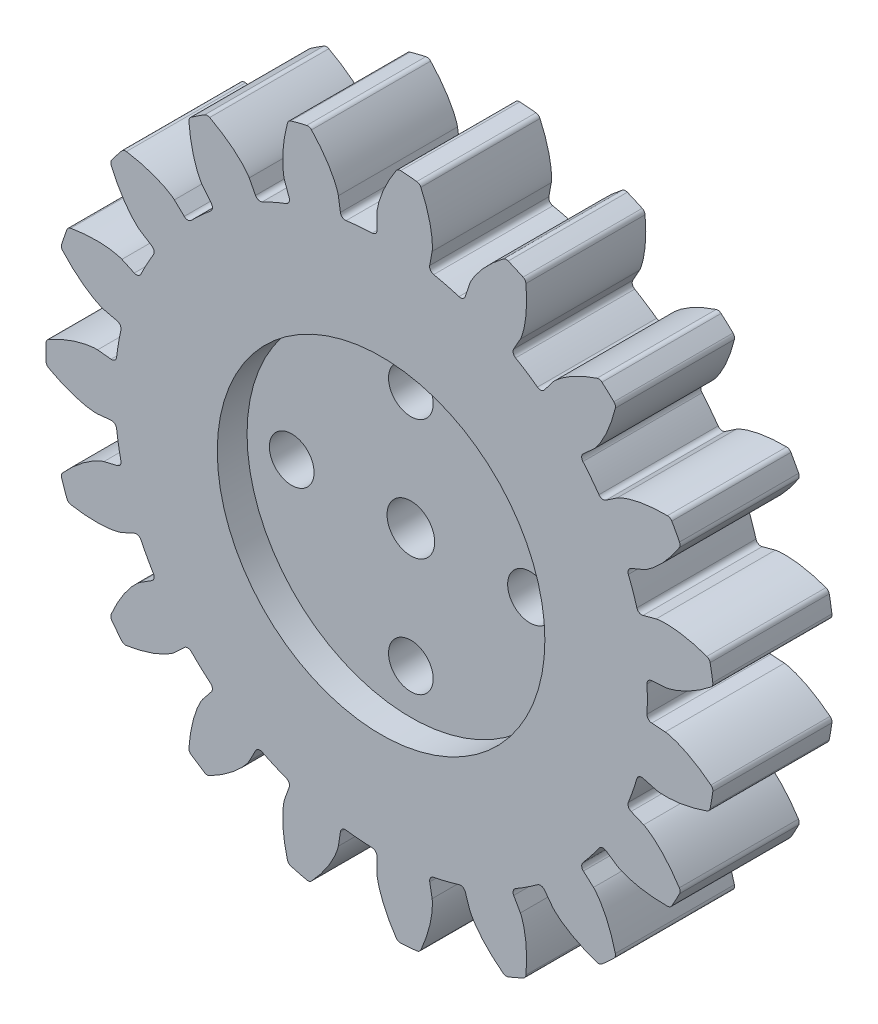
from build123d import *

# Parameters (mm, degrees)
SKETCH10_R                = 22.5
SKETCH10_R_2              = 1.25
BOSS_EXTRUDE5_DEPTH       = 10
CUT_EXTRUDE1_DEPTH        = 34.35416016
FILLET1_R                 = 0.34
CIRPATTERN1_COUNT         = 19
CIRPATTERN1_COPY_1_DEPTH  = 34.35416016
CIRPATTERN1_COPY_2_DEPTH  = 34.35416016
CIRPATTERN1_COPY_3_DEPTH  = 34.35416016
CIRPATTERN1_COPY_4_DEPTH  = 34.35416016
CIRPATTERN1_COPY_5_DEPTH  = 34.35416016
CIRPATTERN1_COPY_6_DEPTH  = 34.35416016
CIRPATTERN1_COPY_7_DEPTH  = 34.35416016
CIRPATTERN1_COPY_8_DEPTH  = 34.35416016
CIRPATTERN1_COPY_9_DEPTH  = 34.35416016
CIRPATTERN1_COPY_10_DEPTH = 34.35416016
CIRPATTERN1_COPY_11_DEPTH = 34.35416016
CIRPATTERN1_COPY_12_DEPTH = 34.35416016
CIRPATTERN1_COPY_13_DEPTH = 34.35416016
CIRPATTERN1_COPY_14_DEPTH = 34.35416016
CIRPATTERN1_COPY_15_DEPTH = 34.35416016
CIRPATTERN1_COPY_16_DEPTH = 34.35416016
CIRPATTERN1_COPY_17_DEPTH = 34.35416016
CIRPATTERN1_COPY_18_DEPTH = 34.35416016
FILLET1_OF_CIRPATTERN1_R  = 0.34
SKETCH12_R                = 11
CUT_EXTRUDE2_DEPTH        = 2
SKETCH13_R                = 1.6
CUT_EXTRUDE3_DEPTH        = 33.784090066
SKETCH14_R                = 1.5
CUT_EXTRUDE4_DEPTH        = 6
CROQUIS1_W                = 59.376573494
CROQUIS1_H                = 51.526039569
CORTAR_EXTRUIR1_DEPTH     = 2


with BuildPart() as part:
    # Sketch10 → Boss-Extrude5 (new body)
    with BuildSketch(Plane.XY):
        Circle(SKETCH10_R)
        Circle(SKETCH10_R_2, mode=Mode.SUBTRACT)
    extrude(amount=BOSS_EXTRUDE5_DEPTH)

    # Sketch11 → Cut-Extrude1 (cut, through all)
    with BuildSketch(Plane.XY.offset(10)):
        with BuildLine():
            Line((17.88, 0), (22.500466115, 0))
            ThreePointArc((22.500466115, 0), (22.451062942, 1.490217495), (22.303070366, 2.973890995))
            add(Edge.make_bspline(
                [(19.085941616, 1.295420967), (19.091347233, 1.295859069), (19.106491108, 1.297307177), (19.135048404, 1.300910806), (19.181520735, 1.308018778), (19.240530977, 1.318877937), (19.316536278, 1.334978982), (19.40569711, 1.356597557), (19.503249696, 1.383126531), (19.608873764, 1.414970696), (19.713766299, 1.449369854), (19.817921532, 1.486125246), (19.921223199, 1.524936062), (20.045785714, 1.574535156), (20.194335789, 1.637599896), (20.366697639, 1.716517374), (20.56061638, 1.812144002), (20.756460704, 1.916106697), (20.947660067, 2.023736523), (21.138990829, 2.138563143), (21.322794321, 2.253970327), (21.511680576, 2.380010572), (21.685008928, 2.499494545), (21.876829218, 2.640122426), (22.030947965, 2.755590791), (22.188094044, 2.880463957), (22.264270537, 2.942063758), (22.303070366, 2.973890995)],
                knots=[0, 0, 0, 0, 0, 0.005376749, 0.015083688, 0.02853182, 0.04661014, 0.064854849, 0.092110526, 0.119476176, 0.146842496, 0.174208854, 0.201574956, 0.228941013, 0.256307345, 0.307035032, 0.361767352, 0.416499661, 0.471231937, 0.525964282, 0.580696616, 0.635428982, 0.690161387, 0.744893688, 0.799626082, 0.854358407, 0.909090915, 0.909090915, 0.909090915, 0.909090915, 0.909090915], degree=4))
            Line((19.085941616, 1.295420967), (17.838957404, 1.210784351))
            ThreePointArc((17.838957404, 1.210784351), (17.869736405, 0.605739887), (17.88, 0))
        make_face()
    cut_extrude1 = extrude(amount=-CUT_EXTRUDE1_DEPTH, mode=Mode.SUBTRACT)

    # Mirror1: Cut-Extrude1 across plane
    add(cut_extrude1.mirror(Plane(origin=(17.88, 0, 0), x_dir=(0, 0, 1), z_dir=(0, -1, 0))), mode=Mode.SUBTRACT)

    # Fillet1
    fillet1_edges = [part.edges().sort_by_distance(p)[0] for p in [
        (17.838957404, -1.210784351, 5),
        (22.302646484, -2.973543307, 5),
        (22.302646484, 2.973543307, 5),
        (17.838957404, 1.210784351, 5),
    ]]
    fillet(fillet1_edges, radius=FILLET1_R)

    # CirPattern1: Cut-Extrude1 ×19 about axis
    cirpattern1_axis = Axis((0, 0, 10), (0, 0, -1))
    for i in range(1, CIRPATTERN1_COUNT):
        add(cut_extrude1.rotate(cirpattern1_axis, i * 360 / CIRPATTERN1_COUNT), mode=Mode.SUBTRACT)

    # CirPattern1 copy 1 sketch → CirPattern1 copy 1 (cut, through all)
    with BuildSketch(Plane(origin=(0, 0, 10), x_dir=(0.9458172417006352, -0.3246994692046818, 0), z_dir=(0, 0, 1))):
        with BuildLine():
            Line((17.88, 0), (22.500466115, 0))
            ThreePointArc((22.500466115, 0), (22.451062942, -1.490217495), (22.303070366, -2.973890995))
            add(Edge.make_bspline(
                [(19.085941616, -1.295420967), (19.091347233, -1.295859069), (19.106491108, -1.297307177), (19.135048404, -1.300910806), (19.181520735, -1.308018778), (19.240530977, -1.318877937), (19.316536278, -1.334978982), (19.40569711, -1.356597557), (19.503249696, -1.383126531), (19.608873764, -1.414970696), (19.713766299, -1.449369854), (19.817921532, -1.486125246), (19.921223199, -1.524936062), (20.045785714, -1.574535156), (20.194335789, -1.637599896), (20.366697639, -1.716517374), (20.56061638, -1.812144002), (20.756460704, -1.916106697), (20.947660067, -2.023736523), (21.138990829, -2.138563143), (21.322794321, -2.253970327), (21.511680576, -2.380010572), (21.685008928, -2.499494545), (21.876829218, -2.640122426), (22.030947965, -2.755590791), (22.188094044, -2.880463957), (22.264270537, -2.942063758), (22.303070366, -2.973890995)],
                knots=[0, 0, 0, 0, 0, 0.005376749, 0.015083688, 0.02853182, 0.04661014, 0.064854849, 0.092110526, 0.119476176, 0.146842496, 0.174208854, 0.201574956, 0.228941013, 0.256307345, 0.307035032, 0.361767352, 0.416499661, 0.471231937, 0.525964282, 0.580696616, 0.635428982, 0.690161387, 0.744893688, 0.799626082, 0.854358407, 0.909090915, 0.909090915, 0.909090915, 0.909090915, 0.909090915], degree=4))
            Line((19.085941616, -1.295420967), (17.838957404, -1.210784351))
            ThreePointArc((17.838957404, -1.210784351), (17.869736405, -0.605739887), (17.88, 0))
        make_face()
    extrude(amount=-CIRPATTERN1_COPY_1_DEPTH, mode=Mode.SUBTRACT)

    # CirPattern1 copy 2 sketch → CirPattern1 copy 2 (cut, through all)
    with BuildSketch(Plane(origin=(0, 0, 10), x_dir=(0.7891405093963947, -0.6142127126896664, 0), z_dir=(0, 0, 1))):
        with BuildLine():
            Line((17.88, 0), (22.500466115, 0))
            ThreePointArc((22.500466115, 0), (22.451062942, -1.490217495), (22.303070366, -2.973890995))
            add(Edge.make_bspline(
                [(19.085941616, -1.295420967), (19.091347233, -1.295859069), (19.106491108, -1.297307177), (19.135048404, -1.300910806), (19.181520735, -1.308018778), (19.240530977, -1.318877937), (19.316536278, -1.334978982), (19.40569711, -1.356597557), (19.503249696, -1.383126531), (19.608873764, -1.414970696), (19.713766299, -1.449369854), (19.817921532, -1.486125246), (19.921223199, -1.524936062), (20.045785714, -1.574535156), (20.194335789, -1.637599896), (20.366697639, -1.716517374), (20.56061638, -1.812144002), (20.756460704, -1.916106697), (20.947660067, -2.023736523), (21.138990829, -2.138563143), (21.322794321, -2.253970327), (21.511680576, -2.380010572), (21.685008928, -2.499494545), (21.876829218, -2.640122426), (22.030947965, -2.755590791), (22.188094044, -2.880463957), (22.264270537, -2.942063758), (22.303070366, -2.973890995)],
                knots=[0, 0, 0, 0, 0, 0.005376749, 0.015083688, 0.02853182, 0.04661014, 0.064854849, 0.092110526, 0.119476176, 0.146842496, 0.174208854, 0.201574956, 0.228941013, 0.256307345, 0.307035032, 0.361767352, 0.416499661, 0.471231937, 0.525964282, 0.580696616, 0.635428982, 0.690161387, 0.744893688, 0.799626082, 0.854358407, 0.909090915, 0.909090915, 0.909090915, 0.909090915, 0.909090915], degree=4))
            Line((19.085941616, -1.295420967), (17.838957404, -1.210784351))
            ThreePointArc((17.838957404, -1.210784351), (17.869736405, -0.605739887), (17.88, 0))
        make_face()
    extrude(amount=-CIRPATTERN1_COPY_2_DEPTH, mode=Mode.SUBTRACT)

    # CirPattern1 copy 3 sketch → CirPattern1 copy 3 (cut, through all)
    with BuildSketch(Plane(origin=(0, 0, 10), x_dir=(0.5469481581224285, -0.8371664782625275, 0), z_dir=(0, 0, 1))):
        with BuildLine():
            Line((17.88, 0), (22.500466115, 0))
            ThreePointArc((22.500466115, 0), (22.451062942, -1.490217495), (22.303070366, -2.973890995))
            add(Edge.make_bspline(
                [(19.085941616, -1.295420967), (19.091347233, -1.295859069), (19.106491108, -1.297307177), (19.135048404, -1.300910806), (19.181520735, -1.308018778), (19.240530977, -1.318877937), (19.316536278, -1.334978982), (19.40569711, -1.356597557), (19.503249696, -1.383126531), (19.608873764, -1.414970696), (19.713766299, -1.449369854), (19.817921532, -1.486125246), (19.921223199, -1.524936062), (20.045785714, -1.574535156), (20.194335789, -1.637599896), (20.366697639, -1.716517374), (20.56061638, -1.812144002), (20.756460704, -1.916106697), (20.947660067, -2.023736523), (21.138990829, -2.138563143), (21.322794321, -2.253970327), (21.511680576, -2.380010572), (21.685008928, -2.499494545), (21.876829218, -2.640122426), (22.030947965, -2.755590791), (22.188094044, -2.880463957), (22.264270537, -2.942063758), (22.303070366, -2.973890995)],
                knots=[0, 0, 0, 0, 0, 0.005376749, 0.015083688, 0.02853182, 0.04661014, 0.064854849, 0.092110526, 0.119476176, 0.146842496, 0.174208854, 0.201574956, 0.228941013, 0.256307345, 0.307035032, 0.361767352, 0.416499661, 0.471231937, 0.525964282, 0.580696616, 0.635428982, 0.690161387, 0.744893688, 0.799626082, 0.854358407, 0.909090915, 0.909090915, 0.909090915, 0.909090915, 0.909090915], degree=4))
            Line((19.085941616, -1.295420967), (17.838957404, -1.210784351))
            ThreePointArc((17.838957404, -1.210784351), (17.869736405, -0.605739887), (17.88, 0))
        make_face()
    extrude(amount=-CIRPATTERN1_COPY_3_DEPTH, mode=Mode.SUBTRACT)

    # CirPattern1 copy 4 sketch → CirPattern1 copy 4 (cut, through all)
    with BuildSketch(Plane(origin=(0, 0, 10), x_dir=(0.24548548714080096, -0.9694002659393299, 0), z_dir=(0, 0, 1))):
        with BuildLine():
            Line((17.88, 0), (22.500466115, 0))
            ThreePointArc((22.500466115, 0), (22.451062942, -1.490217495), (22.303070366, -2.973890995))
            add(Edge.make_bspline(
                [(19.085941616, -1.295420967), (19.091347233, -1.295859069), (19.106491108, -1.297307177), (19.135048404, -1.300910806), (19.181520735, -1.308018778), (19.240530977, -1.318877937), (19.316536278, -1.334978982), (19.40569711, -1.356597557), (19.503249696, -1.383126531), (19.608873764, -1.414970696), (19.713766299, -1.449369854), (19.817921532, -1.486125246), (19.921223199, -1.524936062), (20.045785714, -1.574535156), (20.194335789, -1.637599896), (20.366697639, -1.716517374), (20.56061638, -1.812144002), (20.756460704, -1.916106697), (20.947660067, -2.023736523), (21.138990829, -2.138563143), (21.322794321, -2.253970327), (21.511680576, -2.380010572), (21.685008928, -2.499494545), (21.876829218, -2.640122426), (22.030947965, -2.755590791), (22.188094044, -2.880463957), (22.264270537, -2.942063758), (22.303070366, -2.973890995)],
                knots=[0, 0, 0, 0, 0, 0.005376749, 0.015083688, 0.02853182, 0.04661014, 0.064854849, 0.092110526, 0.119476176, 0.146842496, 0.174208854, 0.201574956, 0.228941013, 0.256307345, 0.307035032, 0.361767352, 0.416499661, 0.471231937, 0.525964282, 0.580696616, 0.635428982, 0.690161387, 0.744893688, 0.799626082, 0.854358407, 0.909090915, 0.909090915, 0.909090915, 0.909090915, 0.909090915], degree=4))
            Line((19.085941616, -1.295420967), (17.838957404, -1.210784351))
            ThreePointArc((17.838957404, -1.210784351), (17.869736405, -0.605739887), (17.88, 0))
        make_face()
    extrude(amount=-CIRPATTERN1_COPY_4_DEPTH, mode=Mode.SUBTRACT)

    # CirPattern1 copy 5 sketch → CirPattern1 copy 5 (cut, through all)
    with BuildSketch(Plane(origin=(0, 0, 10), x_dir=(-0.08257934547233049, -0.99658449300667, 0), z_dir=(0, 0, 1))):
        with BuildLine():
            Line((17.88, 0), (22.500466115, 0))
            ThreePointArc((22.500466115, 0), (22.451062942, -1.490217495), (22.303070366, -2.973890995))
            add(Edge.make_bspline(
                [(19.085941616, -1.295420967), (19.091347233, -1.295859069), (19.106491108, -1.297307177), (19.135048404, -1.300910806), (19.181520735, -1.308018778), (19.240530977, -1.318877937), (19.316536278, -1.334978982), (19.40569711, -1.356597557), (19.503249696, -1.383126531), (19.608873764, -1.414970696), (19.713766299, -1.449369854), (19.817921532, -1.486125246), (19.921223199, -1.524936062), (20.045785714, -1.574535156), (20.194335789, -1.637599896), (20.366697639, -1.716517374), (20.56061638, -1.812144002), (20.756460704, -1.916106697), (20.947660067, -2.023736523), (21.138990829, -2.138563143), (21.322794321, -2.253970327), (21.511680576, -2.380010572), (21.685008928, -2.499494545), (21.876829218, -2.640122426), (22.030947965, -2.755590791), (22.188094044, -2.880463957), (22.264270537, -2.942063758), (22.303070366, -2.973890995)],
                knots=[0, 0, 0, 0, 0, 0.005376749, 0.015083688, 0.02853182, 0.04661014, 0.064854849, 0.092110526, 0.119476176, 0.146842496, 0.174208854, 0.201574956, 0.228941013, 0.256307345, 0.307035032, 0.361767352, 0.416499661, 0.471231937, 0.525964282, 0.580696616, 0.635428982, 0.690161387, 0.744893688, 0.799626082, 0.854358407, 0.909090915, 0.909090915, 0.909090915, 0.909090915, 0.909090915], degree=4))
            Line((19.085941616, -1.295420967), (17.838957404, -1.210784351))
            ThreePointArc((17.838957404, -1.210784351), (17.869736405, -0.605739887), (17.88, 0))
        make_face()
    extrude(amount=-CIRPATTERN1_COPY_5_DEPTH, mode=Mode.SUBTRACT)

    # CirPattern1 copy 6 sketch → CirPattern1 copy 6 (cut, through all)
    with BuildSketch(Plane(origin=(0, 0, 10), x_dir=(-0.4016954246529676, -0.9157733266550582, 0), z_dir=(0, 0, 1))):
        with BuildLine():
            Line((17.88, 0), (22.500466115, 0))
            ThreePointArc((22.500466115, 0), (22.451062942, -1.490217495), (22.303070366, -2.973890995))
            add(Edge.make_bspline(
                [(19.085941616, -1.295420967), (19.091347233, -1.295859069), (19.106491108, -1.297307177), (19.135048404, -1.300910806), (19.181520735, -1.308018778), (19.240530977, -1.318877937), (19.316536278, -1.334978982), (19.40569711, -1.356597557), (19.503249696, -1.383126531), (19.608873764, -1.414970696), (19.713766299, -1.449369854), (19.817921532, -1.486125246), (19.921223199, -1.524936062), (20.045785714, -1.574535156), (20.194335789, -1.637599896), (20.366697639, -1.716517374), (20.56061638, -1.812144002), (20.756460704, -1.916106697), (20.947660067, -2.023736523), (21.138990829, -2.138563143), (21.322794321, -2.253970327), (21.511680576, -2.380010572), (21.685008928, -2.499494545), (21.876829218, -2.640122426), (22.030947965, -2.755590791), (22.188094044, -2.880463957), (22.264270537, -2.942063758), (22.303070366, -2.973890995)],
                knots=[0, 0, 0, 0, 0, 0.005376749, 0.015083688, 0.02853182, 0.04661014, 0.064854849, 0.092110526, 0.119476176, 0.146842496, 0.174208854, 0.201574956, 0.228941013, 0.256307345, 0.307035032, 0.361767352, 0.416499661, 0.471231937, 0.525964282, 0.580696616, 0.635428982, 0.690161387, 0.744893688, 0.799626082, 0.854358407, 0.909090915, 0.909090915, 0.909090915, 0.909090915, 0.909090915], degree=4))
            Line((19.085941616, -1.295420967), (17.838957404, -1.210784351))
            ThreePointArc((17.838957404, -1.210784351), (17.869736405, -0.605739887), (17.88, 0))
        make_face()
    extrude(amount=-CIRPATTERN1_COPY_6_DEPTH, mode=Mode.SUBTRACT)

    # CirPattern1 copy 7 sketch → CirPattern1 copy 7 (cut, through all)
    with BuildSketch(Plane(origin=(0, 0, 10), x_dir=(-0.6772815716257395, -0.735723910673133, 0), z_dir=(0, 0, 1))):
        with BuildLine():
            Line((17.88, 0), (22.500466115, 0))
            ThreePointArc((22.500466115, 0), (22.451062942, -1.490217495), (22.303070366, -2.973890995))
            add(Edge.make_bspline(
                [(19.085941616, -1.295420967), (19.091347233, -1.295859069), (19.106491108, -1.297307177), (19.135048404, -1.300910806), (19.181520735, -1.308018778), (19.240530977, -1.318877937), (19.316536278, -1.334978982), (19.40569711, -1.356597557), (19.503249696, -1.383126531), (19.608873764, -1.414970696), (19.713766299, -1.449369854), (19.817921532, -1.486125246), (19.921223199, -1.524936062), (20.045785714, -1.574535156), (20.194335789, -1.637599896), (20.366697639, -1.716517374), (20.56061638, -1.812144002), (20.756460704, -1.916106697), (20.947660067, -2.023736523), (21.138990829, -2.138563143), (21.322794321, -2.253970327), (21.511680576, -2.380010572), (21.685008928, -2.499494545), (21.876829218, -2.640122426), (22.030947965, -2.755590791), (22.188094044, -2.880463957), (22.264270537, -2.942063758), (22.303070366, -2.973890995)],
                knots=[0, 0, 0, 0, 0, 0.005376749, 0.015083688, 0.02853182, 0.04661014, 0.064854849, 0.092110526, 0.119476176, 0.146842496, 0.174208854, 0.201574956, 0.228941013, 0.256307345, 0.307035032, 0.361767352, 0.416499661, 0.471231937, 0.525964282, 0.580696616, 0.635428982, 0.690161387, 0.744893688, 0.799626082, 0.854358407, 0.909090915, 0.909090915, 0.909090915, 0.909090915, 0.909090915], degree=4))
            Line((19.085941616, -1.295420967), (17.838957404, -1.210784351))
            ThreePointArc((17.838957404, -1.210784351), (17.869736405, -0.605739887), (17.88, 0))
        make_face()
    extrude(amount=-CIRPATTERN1_COPY_7_DEPTH, mode=Mode.SUBTRACT)

    # CirPattern1 copy 8 sketch → CirPattern1 copy 8 (cut, through all)
    with BuildSketch(Plane(origin=(0, 0, 10), x_dir=(-0.8794737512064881, -0.47594739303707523, 0), z_dir=(0, 0, 1))):
        with BuildLine():
            Line((17.88, 0), (22.500466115, 0))
            ThreePointArc((22.500466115, 0), (22.451062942, -1.490217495), (22.303070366, -2.973890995))
            add(Edge.make_bspline(
                [(19.085941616, -1.295420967), (19.091347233, -1.295859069), (19.106491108, -1.297307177), (19.135048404, -1.300910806), (19.181520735, -1.308018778), (19.240530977, -1.318877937), (19.316536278, -1.334978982), (19.40569711, -1.356597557), (19.503249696, -1.383126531), (19.608873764, -1.414970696), (19.713766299, -1.449369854), (19.817921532, -1.486125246), (19.921223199, -1.524936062), (20.045785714, -1.574535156), (20.194335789, -1.637599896), (20.366697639, -1.716517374), (20.56061638, -1.812144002), (20.756460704, -1.916106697), (20.947660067, -2.023736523), (21.138990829, -2.138563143), (21.322794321, -2.253970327), (21.511680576, -2.380010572), (21.685008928, -2.499494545), (21.876829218, -2.640122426), (22.030947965, -2.755590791), (22.188094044, -2.880463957), (22.264270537, -2.942063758), (22.303070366, -2.973890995)],
                knots=[0, 0, 0, 0, 0, 0.005376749, 0.015083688, 0.02853182, 0.04661014, 0.064854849, 0.092110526, 0.119476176, 0.146842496, 0.174208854, 0.201574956, 0.228941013, 0.256307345, 0.307035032, 0.361767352, 0.416499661, 0.471231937, 0.525964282, 0.580696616, 0.635428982, 0.690161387, 0.744893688, 0.799626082, 0.854358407, 0.909090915, 0.909090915, 0.909090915, 0.909090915, 0.909090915], degree=4))
            Line((19.085941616, -1.295420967), (17.838957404, -1.210784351))
            ThreePointArc((17.838957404, -1.210784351), (17.869736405, -0.605739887), (17.88, 0))
        make_face()
    extrude(amount=-CIRPATTERN1_COPY_8_DEPTH, mode=Mode.SUBTRACT)

    # CirPattern1 copy 9 sketch → CirPattern1 copy 9 (cut, through all)
    with BuildSketch(Plane(origin=(0, 0, 10), x_dir=(-0.986361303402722, -0.1645945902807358, 0), z_dir=(0, 0, 1))):
        with BuildLine():
            Line((17.88, 0), (22.500466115, 0))
            ThreePointArc((22.500466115, 0), (22.451062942, -1.490217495), (22.303070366, -2.973890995))
            add(Edge.make_bspline(
                [(19.085941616, -1.295420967), (19.091347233, -1.295859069), (19.106491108, -1.297307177), (19.135048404, -1.300910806), (19.181520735, -1.308018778), (19.240530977, -1.318877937), (19.316536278, -1.334978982), (19.40569711, -1.356597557), (19.503249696, -1.383126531), (19.608873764, -1.414970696), (19.713766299, -1.449369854), (19.817921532, -1.486125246), (19.921223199, -1.524936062), (20.045785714, -1.574535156), (20.194335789, -1.637599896), (20.366697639, -1.716517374), (20.56061638, -1.812144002), (20.756460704, -1.916106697), (20.947660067, -2.023736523), (21.138990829, -2.138563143), (21.322794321, -2.253970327), (21.511680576, -2.380010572), (21.685008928, -2.499494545), (21.876829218, -2.640122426), (22.030947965, -2.755590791), (22.188094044, -2.880463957), (22.264270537, -2.942063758), (22.303070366, -2.973890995)],
                knots=[0, 0, 0, 0, 0, 0.005376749, 0.015083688, 0.02853182, 0.04661014, 0.064854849, 0.092110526, 0.119476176, 0.146842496, 0.174208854, 0.201574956, 0.228941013, 0.256307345, 0.307035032, 0.361767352, 0.416499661, 0.471231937, 0.525964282, 0.580696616, 0.635428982, 0.690161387, 0.744893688, 0.799626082, 0.854358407, 0.909090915, 0.909090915, 0.909090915, 0.909090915, 0.909090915], degree=4))
            Line((19.085941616, -1.295420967), (17.838957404, -1.210784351))
            ThreePointArc((17.838957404, -1.210784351), (17.869736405, -0.605739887), (17.88, 0))
        make_face()
    extrude(amount=-CIRPATTERN1_COPY_9_DEPTH, mode=Mode.SUBTRACT)

    # CirPattern1 copy 10 sketch → CirPattern1 copy 10 (cut, through all)
    with BuildSketch(Plane(origin=(0, 0, 10), x_dir=(-0.9863613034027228, 0.164594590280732, 0), z_dir=(0, 0, 1))):
        with BuildLine():
            Line((17.88, 0), (22.500466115, 0))
            ThreePointArc((22.500466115, 0), (22.451062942, -1.490217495), (22.303070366, -2.973890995))
            add(Edge.make_bspline(
                [(19.085941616, -1.295420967), (19.091347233, -1.295859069), (19.106491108, -1.297307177), (19.135048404, -1.300910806), (19.181520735, -1.308018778), (19.240530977, -1.318877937), (19.316536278, -1.334978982), (19.40569711, -1.356597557), (19.503249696, -1.383126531), (19.608873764, -1.414970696), (19.713766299, -1.449369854), (19.817921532, -1.486125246), (19.921223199, -1.524936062), (20.045785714, -1.574535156), (20.194335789, -1.637599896), (20.366697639, -1.716517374), (20.56061638, -1.812144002), (20.756460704, -1.916106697), (20.947660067, -2.023736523), (21.138990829, -2.138563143), (21.322794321, -2.253970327), (21.511680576, -2.380010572), (21.685008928, -2.499494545), (21.876829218, -2.640122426), (22.030947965, -2.755590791), (22.188094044, -2.880463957), (22.264270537, -2.942063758), (22.303070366, -2.973890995)],
                knots=[0, 0, 0, 0, 0, 0.005376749, 0.015083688, 0.02853182, 0.04661014, 0.064854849, 0.092110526, 0.119476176, 0.146842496, 0.174208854, 0.201574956, 0.228941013, 0.256307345, 0.307035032, 0.361767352, 0.416499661, 0.471231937, 0.525964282, 0.580696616, 0.635428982, 0.690161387, 0.744893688, 0.799626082, 0.854358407, 0.909090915, 0.909090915, 0.909090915, 0.909090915, 0.909090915], degree=4))
            Line((19.085941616, -1.295420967), (17.838957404, -1.210784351))
            ThreePointArc((17.838957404, -1.210784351), (17.869736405, -0.605739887), (17.88, 0))
        make_face()
    extrude(amount=-CIRPATTERN1_COPY_10_DEPTH, mode=Mode.SUBTRACT)

    # CirPattern1 copy 11 sketch → CirPattern1 copy 11 (cut, through all)
    with BuildSketch(Plane(origin=(0, 0, 10), x_dir=(-0.8794737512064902, 0.47594739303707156, 0), z_dir=(0, 0, 1))):
        with BuildLine():
            Line((17.88, 0), (22.500466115, 0))
            ThreePointArc((22.500466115, 0), (22.451062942, -1.490217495), (22.303070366, -2.973890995))
            add(Edge.make_bspline(
                [(19.085941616, -1.295420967), (19.091347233, -1.295859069), (19.106491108, -1.297307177), (19.135048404, -1.300910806), (19.181520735, -1.308018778), (19.240530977, -1.318877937), (19.316536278, -1.334978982), (19.40569711, -1.356597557), (19.503249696, -1.383126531), (19.608873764, -1.414970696), (19.713766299, -1.449369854), (19.817921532, -1.486125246), (19.921223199, -1.524936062), (20.045785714, -1.574535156), (20.194335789, -1.637599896), (20.366697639, -1.716517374), (20.56061638, -1.812144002), (20.756460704, -1.916106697), (20.947660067, -2.023736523), (21.138990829, -2.138563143), (21.322794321, -2.253970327), (21.511680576, -2.380010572), (21.685008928, -2.499494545), (21.876829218, -2.640122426), (22.030947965, -2.755590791), (22.188094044, -2.880463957), (22.264270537, -2.942063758), (22.303070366, -2.973890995)],
                knots=[0, 0, 0, 0, 0, 0.005376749, 0.015083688, 0.02853182, 0.04661014, 0.064854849, 0.092110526, 0.119476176, 0.146842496, 0.174208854, 0.201574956, 0.228941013, 0.256307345, 0.307035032, 0.361767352, 0.416499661, 0.471231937, 0.525964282, 0.580696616, 0.635428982, 0.690161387, 0.744893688, 0.799626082, 0.854358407, 0.909090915, 0.909090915, 0.909090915, 0.909090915, 0.909090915], degree=4))
            Line((19.085941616, -1.295420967), (17.838957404, -1.210784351))
            ThreePointArc((17.838957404, -1.210784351), (17.869736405, -0.605739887), (17.88, 0))
        make_face()
    extrude(amount=-CIRPATTERN1_COPY_11_DEPTH, mode=Mode.SUBTRACT)

    # CirPattern1 copy 12 sketch → CirPattern1 copy 12 (cut, through all)
    with BuildSketch(Plane(origin=(0, 0, 10), x_dir=(-0.6772815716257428, 0.73572391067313, 0), z_dir=(0, 0, 1))):
        with BuildLine():
            Line((17.88, 0), (22.500466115, 0))
            ThreePointArc((22.500466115, 0), (22.451062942, -1.490217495), (22.303070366, -2.973890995))
            add(Edge.make_bspline(
                [(19.085941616, -1.295420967), (19.091347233, -1.295859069), (19.106491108, -1.297307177), (19.135048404, -1.300910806), (19.181520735, -1.308018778), (19.240530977, -1.318877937), (19.316536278, -1.334978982), (19.40569711, -1.356597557), (19.503249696, -1.383126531), (19.608873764, -1.414970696), (19.713766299, -1.449369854), (19.817921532, -1.486125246), (19.921223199, -1.524936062), (20.045785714, -1.574535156), (20.194335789, -1.637599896), (20.366697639, -1.716517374), (20.56061638, -1.812144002), (20.756460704, -1.916106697), (20.947660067, -2.023736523), (21.138990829, -2.138563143), (21.322794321, -2.253970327), (21.511680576, -2.380010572), (21.685008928, -2.499494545), (21.876829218, -2.640122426), (22.030947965, -2.755590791), (22.188094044, -2.880463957), (22.264270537, -2.942063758), (22.303070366, -2.973890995)],
                knots=[0, 0, 0, 0, 0, 0.005376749, 0.015083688, 0.02853182, 0.04661014, 0.064854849, 0.092110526, 0.119476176, 0.146842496, 0.174208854, 0.201574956, 0.228941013, 0.256307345, 0.307035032, 0.361767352, 0.416499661, 0.471231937, 0.525964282, 0.580696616, 0.635428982, 0.690161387, 0.744893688, 0.799626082, 0.854358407, 0.909090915, 0.909090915, 0.909090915, 0.909090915, 0.909090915], degree=4))
            Line((19.085941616, -1.295420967), (17.838957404, -1.210784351))
            ThreePointArc((17.838957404, -1.210784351), (17.869736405, -0.605739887), (17.88, 0))
        make_face()
    extrude(amount=-CIRPATTERN1_COPY_12_DEPTH, mode=Mode.SUBTRACT)

    # CirPattern1 copy 13 sketch → CirPattern1 copy 13 (cut, through all)
    with BuildSketch(Plane(origin=(0, 0, 10), x_dir=(-0.40169542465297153, 0.9157733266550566, 0), z_dir=(0, 0, 1))):
        with BuildLine():
            Line((17.88, 0), (22.500466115, 0))
            ThreePointArc((22.500466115, 0), (22.451062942, -1.490217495), (22.303070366, -2.973890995))
            add(Edge.make_bspline(
                [(19.085941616, -1.295420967), (19.091347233, -1.295859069), (19.106491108, -1.297307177), (19.135048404, -1.300910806), (19.181520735, -1.308018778), (19.240530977, -1.318877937), (19.316536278, -1.334978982), (19.40569711, -1.356597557), (19.503249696, -1.383126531), (19.608873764, -1.414970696), (19.713766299, -1.449369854), (19.817921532, -1.486125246), (19.921223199, -1.524936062), (20.045785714, -1.574535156), (20.194335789, -1.637599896), (20.366697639, -1.716517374), (20.56061638, -1.812144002), (20.756460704, -1.916106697), (20.947660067, -2.023736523), (21.138990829, -2.138563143), (21.322794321, -2.253970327), (21.511680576, -2.380010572), (21.685008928, -2.499494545), (21.876829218, -2.640122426), (22.030947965, -2.755590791), (22.188094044, -2.880463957), (22.264270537, -2.942063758), (22.303070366, -2.973890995)],
                knots=[0, 0, 0, 0, 0, 0.005376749, 0.015083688, 0.02853182, 0.04661014, 0.064854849, 0.092110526, 0.119476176, 0.146842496, 0.174208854, 0.201574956, 0.228941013, 0.256307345, 0.307035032, 0.361767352, 0.416499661, 0.471231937, 0.525964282, 0.580696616, 0.635428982, 0.690161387, 0.744893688, 0.799626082, 0.854358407, 0.909090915, 0.909090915, 0.909090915, 0.909090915, 0.909090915], degree=4))
            Line((19.085941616, -1.295420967), (17.838957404, -1.210784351))
            ThreePointArc((17.838957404, -1.210784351), (17.869736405, -0.605739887), (17.88, 0))
        make_face()
    extrude(amount=-CIRPATTERN1_COPY_13_DEPTH, mode=Mode.SUBTRACT)

    # CirPattern1 copy 14 sketch → CirPattern1 copy 14 (cut, through all)
    with BuildSketch(Plane(origin=(0, 0, 10), x_dir=(-0.08257934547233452, 0.9965844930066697, 0), z_dir=(0, 0, 1))):
        with BuildLine():
            Line((17.88, 0), (22.500466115, 0))
            ThreePointArc((22.500466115, 0), (22.451062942, -1.490217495), (22.303070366, -2.973890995))
            add(Edge.make_bspline(
                [(19.085941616, -1.295420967), (19.091347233, -1.295859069), (19.106491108, -1.297307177), (19.135048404, -1.300910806), (19.181520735, -1.308018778), (19.240530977, -1.318877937), (19.316536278, -1.334978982), (19.40569711, -1.356597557), (19.503249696, -1.383126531), (19.608873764, -1.414970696), (19.713766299, -1.449369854), (19.817921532, -1.486125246), (19.921223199, -1.524936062), (20.045785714, -1.574535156), (20.194335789, -1.637599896), (20.366697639, -1.716517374), (20.56061638, -1.812144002), (20.756460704, -1.916106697), (20.947660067, -2.023736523), (21.138990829, -2.138563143), (21.322794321, -2.253970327), (21.511680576, -2.380010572), (21.685008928, -2.499494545), (21.876829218, -2.640122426), (22.030947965, -2.755590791), (22.188094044, -2.880463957), (22.264270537, -2.942063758), (22.303070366, -2.973890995)],
                knots=[0, 0, 0, 0, 0, 0.005376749, 0.015083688, 0.02853182, 0.04661014, 0.064854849, 0.092110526, 0.119476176, 0.146842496, 0.174208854, 0.201574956, 0.228941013, 0.256307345, 0.307035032, 0.361767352, 0.416499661, 0.471231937, 0.525964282, 0.580696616, 0.635428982, 0.690161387, 0.744893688, 0.799626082, 0.854358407, 0.909090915, 0.909090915, 0.909090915, 0.909090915, 0.909090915], degree=4))
            Line((19.085941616, -1.295420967), (17.838957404, -1.210784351))
            ThreePointArc((17.838957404, -1.210784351), (17.869736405, -0.605739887), (17.88, 0))
        make_face()
    extrude(amount=-CIRPATTERN1_COPY_14_DEPTH, mode=Mode.SUBTRACT)

    # CirPattern1 copy 15 sketch → CirPattern1 copy 15 (cut, through all)
    with BuildSketch(Plane(origin=(0, 0, 10), x_dir=(0.24548548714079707, 0.9694002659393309, 0), z_dir=(0, 0, 1))):
        with BuildLine():
            Line((17.88, 0), (22.500466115, 0))
            ThreePointArc((22.500466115, 0), (22.451062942, -1.490217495), (22.303070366, -2.973890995))
            add(Edge.make_bspline(
                [(19.085941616, -1.295420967), (19.091347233, -1.295859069), (19.106491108, -1.297307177), (19.135048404, -1.300910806), (19.181520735, -1.308018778), (19.240530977, -1.318877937), (19.316536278, -1.334978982), (19.40569711, -1.356597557), (19.503249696, -1.383126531), (19.608873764, -1.414970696), (19.713766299, -1.449369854), (19.817921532, -1.486125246), (19.921223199, -1.524936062), (20.045785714, -1.574535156), (20.194335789, -1.637599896), (20.366697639, -1.716517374), (20.56061638, -1.812144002), (20.756460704, -1.916106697), (20.947660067, -2.023736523), (21.138990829, -2.138563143), (21.322794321, -2.253970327), (21.511680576, -2.380010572), (21.685008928, -2.499494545), (21.876829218, -2.640122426), (22.030947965, -2.755590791), (22.188094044, -2.880463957), (22.264270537, -2.942063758), (22.303070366, -2.973890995)],
                knots=[0, 0, 0, 0, 0, 0.005376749, 0.015083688, 0.02853182, 0.04661014, 0.064854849, 0.092110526, 0.119476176, 0.146842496, 0.174208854, 0.201574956, 0.228941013, 0.256307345, 0.307035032, 0.361767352, 0.416499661, 0.471231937, 0.525964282, 0.580696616, 0.635428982, 0.690161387, 0.744893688, 0.799626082, 0.854358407, 0.909090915, 0.909090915, 0.909090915, 0.909090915, 0.909090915], degree=4))
            Line((19.085941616, -1.295420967), (17.838957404, -1.210784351))
            ThreePointArc((17.838957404, -1.210784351), (17.869736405, -0.605739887), (17.88, 0))
        make_face()
    extrude(amount=-CIRPATTERN1_COPY_15_DEPTH, mode=Mode.SUBTRACT)

    # CirPattern1 copy 16 sketch → CirPattern1 copy 16 (cut, through all)
    with BuildSketch(Plane(origin=(0, 0, 10), x_dir=(0.5469481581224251, 0.8371664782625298, 0), z_dir=(0, 0, 1))):
        with BuildLine():
            Line((17.88, 0), (22.500466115, 0))
            ThreePointArc((22.500466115, 0), (22.451062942, -1.490217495), (22.303070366, -2.973890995))
            add(Edge.make_bspline(
                [(19.085941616, -1.295420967), (19.091347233, -1.295859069), (19.106491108, -1.297307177), (19.135048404, -1.300910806), (19.181520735, -1.308018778), (19.240530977, -1.318877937), (19.316536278, -1.334978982), (19.40569711, -1.356597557), (19.503249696, -1.383126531), (19.608873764, -1.414970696), (19.713766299, -1.449369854), (19.817921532, -1.486125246), (19.921223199, -1.524936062), (20.045785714, -1.574535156), (20.194335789, -1.637599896), (20.366697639, -1.716517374), (20.56061638, -1.812144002), (20.756460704, -1.916106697), (20.947660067, -2.023736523), (21.138990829, -2.138563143), (21.322794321, -2.253970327), (21.511680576, -2.380010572), (21.685008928, -2.499494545), (21.876829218, -2.640122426), (22.030947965, -2.755590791), (22.188094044, -2.880463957), (22.264270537, -2.942063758), (22.303070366, -2.973890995)],
                knots=[0, 0, 0, 0, 0, 0.005376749, 0.015083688, 0.02853182, 0.04661014, 0.064854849, 0.092110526, 0.119476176, 0.146842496, 0.174208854, 0.201574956, 0.228941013, 0.256307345, 0.307035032, 0.361767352, 0.416499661, 0.471231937, 0.525964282, 0.580696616, 0.635428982, 0.690161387, 0.744893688, 0.799626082, 0.854358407, 0.909090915, 0.909090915, 0.909090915, 0.909090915, 0.909090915], degree=4))
            Line((19.085941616, -1.295420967), (17.838957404, -1.210784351))
            ThreePointArc((17.838957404, -1.210784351), (17.869736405, -0.605739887), (17.88, 0))
        make_face()
    extrude(amount=-CIRPATTERN1_COPY_16_DEPTH, mode=Mode.SUBTRACT)

    # CirPattern1 copy 17 sketch → CirPattern1 copy 17 (cut, through all)
    with BuildSketch(Plane(origin=(0, 0, 10), x_dir=(0.7891405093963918, 0.6142127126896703, 0), z_dir=(0, 0, 1))):
        with BuildLine():
            Line((17.88, 0), (22.500466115, 0))
            ThreePointArc((22.500466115, 0), (22.451062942, -1.490217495), (22.303070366, -2.973890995))
            add(Edge.make_bspline(
                [(19.085941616, -1.295420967), (19.091347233, -1.295859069), (19.106491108, -1.297307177), (19.135048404, -1.300910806), (19.181520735, -1.308018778), (19.240530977, -1.318877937), (19.316536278, -1.334978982), (19.40569711, -1.356597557), (19.503249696, -1.383126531), (19.608873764, -1.414970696), (19.713766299, -1.449369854), (19.817921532, -1.486125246), (19.921223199, -1.524936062), (20.045785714, -1.574535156), (20.194335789, -1.637599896), (20.366697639, -1.716517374), (20.56061638, -1.812144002), (20.756460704, -1.916106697), (20.947660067, -2.023736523), (21.138990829, -2.138563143), (21.322794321, -2.253970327), (21.511680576, -2.380010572), (21.685008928, -2.499494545), (21.876829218, -2.640122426), (22.030947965, -2.755590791), (22.188094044, -2.880463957), (22.264270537, -2.942063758), (22.303070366, -2.973890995)],
                knots=[0, 0, 0, 0, 0, 0.005376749, 0.015083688, 0.02853182, 0.04661014, 0.064854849, 0.092110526, 0.119476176, 0.146842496, 0.174208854, 0.201574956, 0.228941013, 0.256307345, 0.307035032, 0.361767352, 0.416499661, 0.471231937, 0.525964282, 0.580696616, 0.635428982, 0.690161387, 0.744893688, 0.799626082, 0.854358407, 0.909090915, 0.909090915, 0.909090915, 0.909090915, 0.909090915], degree=4))
            Line((19.085941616, -1.295420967), (17.838957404, -1.210784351))
            ThreePointArc((17.838957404, -1.210784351), (17.869736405, -0.605739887), (17.88, 0))
        make_face()
    extrude(amount=-CIRPATTERN1_COPY_17_DEPTH, mode=Mode.SUBTRACT)

    # CirPattern1 copy 18 sketch → CirPattern1 copy 18 (cut, through all)
    with BuildSketch(Plane(origin=(0, 0, 10), x_dir=(0.9458172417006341, 0.3246994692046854, 0), z_dir=(0, 0, 1))):
        with BuildLine():
            Line((17.88, 0), (22.500466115, 0))
            ThreePointArc((22.500466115, 0), (22.451062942, -1.490217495), (22.303070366, -2.973890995))
            add(Edge.make_bspline(
                [(19.085941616, -1.295420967), (19.091347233, -1.295859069), (19.106491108, -1.297307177), (19.135048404, -1.300910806), (19.181520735, -1.308018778), (19.240530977, -1.318877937), (19.316536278, -1.334978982), (19.40569711, -1.356597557), (19.503249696, -1.383126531), (19.608873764, -1.414970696), (19.713766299, -1.449369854), (19.817921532, -1.486125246), (19.921223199, -1.524936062), (20.045785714, -1.574535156), (20.194335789, -1.637599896), (20.366697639, -1.716517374), (20.56061638, -1.812144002), (20.756460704, -1.916106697), (20.947660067, -2.023736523), (21.138990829, -2.138563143), (21.322794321, -2.253970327), (21.511680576, -2.380010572), (21.685008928, -2.499494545), (21.876829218, -2.640122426), (22.030947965, -2.755590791), (22.188094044, -2.880463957), (22.264270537, -2.942063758), (22.303070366, -2.973890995)],
                knots=[0, 0, 0, 0, 0, 0.005376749, 0.015083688, 0.02853182, 0.04661014, 0.064854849, 0.092110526, 0.119476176, 0.146842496, 0.174208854, 0.201574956, 0.228941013, 0.256307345, 0.307035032, 0.361767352, 0.416499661, 0.471231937, 0.525964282, 0.580696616, 0.635428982, 0.690161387, 0.744893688, 0.799626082, 0.854358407, 0.909090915, 0.909090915, 0.909090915, 0.909090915, 0.909090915], degree=4))
            Line((19.085941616, -1.295420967), (17.838957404, -1.210784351))
            ThreePointArc((17.838957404, -1.210784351), (17.869736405, -0.605739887), (17.88, 0))
        make_face()
    extrude(amount=-CIRPATTERN1_COPY_18_DEPTH, mode=Mode.SUBTRACT)

    # Fillet1 of CirPattern1
    fillet1_of_cirpattern1_edges = [part.edges().sort_by_distance(p)[0] for p in [
        (16.47925245, -6.937480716, 5),
        (20.128719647, -10.054086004, 5),
        (22.059735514, -4.429228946, 5),
        (17.265534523, -4.647119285, 5),
        (13.333764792, -11.912393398, 5),
        (15.773533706, -16.045112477, 5),
        (19.426309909, -11.352025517, 5),
        (14.821123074, -10.001435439, 5),
        (8.743356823, -15.596413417, 5),
        (9.709040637, -20.297402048, 5),
        (14.687742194, -17.044653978, 5),
        (10.770612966, -14.271940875, 5),
        (3.205470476, -17.590320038, 5),
        (2.592422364, -22.35015316, 5),
        (8.35752971, -20.890229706, 5),
        (5.552939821, -16.995860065, 5),
        (-2.679778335, -17.678042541, 5),
        (-4.805125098, -21.980918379, 5),
        (1.1216492, -22.472024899, 5),
        (-0.266480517, -17.878014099, 5),
        (-8.274631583, -15.850074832, 5),
        (-11.681962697, -19.229710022, 5),
        (-6.235779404, -21.618627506, 5),
        (-6.057023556, -16.8228079, 5),
        (-12.972800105, -12.304505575, 5),
        (-17.292878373, -14.394664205, 5),
        (-12.917464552, -18.422516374, 5),
        (-11.191194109, -13.944589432, 5),
        (-16.265164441, -7.425552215, 5),
        (-21.029842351, -7.999733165, 5),
        (-18.19934198, -13.230039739, 5),
        (-15.11262513, -9.555258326, 5),
        (-17.79494583, -1.741925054, 5),
        (-22.487896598, -0.737906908, 5),
        (-21.509038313, -6.603883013, 5),
        (-17.396368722, -4.130466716, 5),
        (-17.396368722, 4.130466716, 5),
        (-21.509038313, 6.603883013, 5),
        (-22.487896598, 0.737906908, 5),
        (-17.79494583, 1.741925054, 5),
        (-15.11262513, 9.555258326, 5),
        (-18.19934198, 13.230039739, 5),
        (-21.029842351, 7.999733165, 5),
        (-16.265164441, 7.425552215, 5),
        (-11.191194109, 13.944589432, 5),
        (-12.917464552, 18.422516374, 5),
        (-17.292878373, 14.394664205, 5),
        (-12.972800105, 12.304505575, 5),
        (-6.057023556, 16.8228079, 5),
        (-6.235779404, 21.618627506, 5),
        (-11.681962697, 19.229710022, 5),
        (-8.274631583, 15.850074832, 5),
        (-0.266480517, 17.878014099, 5),
        (1.1216492, 22.472024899, 5),
        (-4.805125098, 21.980918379, 5),
        (-2.679778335, 17.678042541, 5),
        (5.552939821, 16.995860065, 5),
        (8.35752971, 20.890229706, 5),
        (2.592422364, 22.35015316, 5),
        (3.205470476, 17.590320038, 5),
        (10.770612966, 14.271940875, 5),
        (14.687742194, 17.044653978, 5),
        (9.709040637, 20.297402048, 5),
        (8.743356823, 15.596413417, 5),
        (14.821123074, 10.001435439, 5),
        (19.426309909, 11.352025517, 5),
        (15.773533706, 16.045112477, 5),
        (13.333764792, 11.912393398, 5),
        (17.265534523, 4.647119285, 5),
        (22.059735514, 4.429228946, 5),
        (20.128719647, 10.054086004, 5),
        (16.47925245, 6.937480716, 5),
    ]]
    fillet(fillet1_of_cirpattern1_edges, radius=FILLET1_OF_CIRPATTERN1_R)

    # Sketch12 → Cut-Extrude2 (cut)
    with BuildSketch(Plane.XY.offset(10)):
        Circle(SKETCH12_R)
    extrude(amount=-CUT_EXTRUDE2_DEPTH, mode=Mode.SUBTRACT)

    # Sketch13 → Cut-Extrude3 (cut, through all)
    with BuildSketch(Plane.XY.offset(8)):
        Circle(SKETCH13_R)
    extrude(amount=-CUT_EXTRUDE3_DEPTH, mode=Mode.SUBTRACT)

    # Sketch14 → Cut-Extrude4 (cut)
    with BuildSketch(Plane.XY.offset(8)):
        with Locations((0, 8)):
            Circle(SKETCH14_R)
        with Locations((8, 0)):
            Circle(SKETCH14_R)
        with Locations((0, -8)):
            Circle(SKETCH14_R)
        with Locations((-8, 0)):
            Circle(SKETCH14_R)
    extrude(amount=-CUT_EXTRUDE4_DEPTH, mode=Mode.SUBTRACT)

    # Croquis1 → Cortar-Extruir1 (cut)
    with BuildSketch(Plane(origin=(0, 0, 0), x_dir=(-1, 0, 0), z_dir=(0, 0, -1))):
        with Locations((0.386630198, -0.165856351)):
            Rectangle(CROQUIS1_W, CROQUIS1_H)
    extrude(amount=-CORTAR_EXTRUIR1_DEPTH, mode=Mode.SUBTRACT)


solid = part.part
